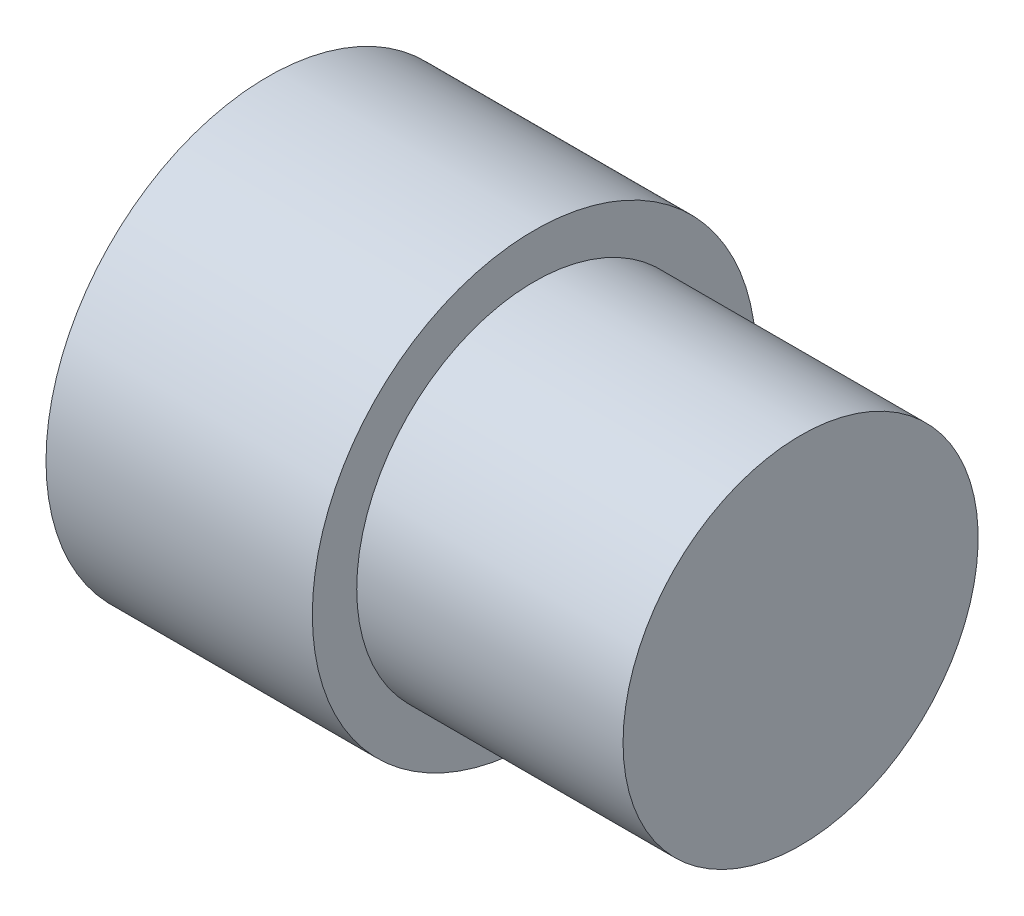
ISO-10303-21;
HEADER;
FILE_DESCRIPTION(('STEP AP214'),'2;1');
FILE_NAME('part.step','',(''),(''),'','','');
FILE_SCHEMA(('AUTOMOTIVE_DESIGN { 1 0 10303 214 1 1 1 1 }'));
ENDSEC;
DATA;
#1=APPLICATION_CONTEXT('core data for automotive mechanical design processes');
#2=APPLICATION_PROTOCOL_DEFINITION('international standard','automotive_design',2000,#1);
#3=PRODUCT_CONTEXT('',#1,'mechanical');
#4=PRODUCT('Part','Part','',(#3));
#5=PRODUCT_RELATED_PRODUCT_CATEGORY('part','',(#4));
#6=PRODUCT_DEFINITION_FORMATION('','',#4);
#7=PRODUCT_DEFINITION_CONTEXT('part definition',#1,'design');
#8=PRODUCT_DEFINITION('design','',#6,#7);
#9=PRODUCT_DEFINITION_SHAPE('','',#8);
#10=(LENGTH_UNIT() NAMED_UNIT(*) SI_UNIT(.MILLI.,.METRE.));
#11=(NAMED_UNIT(*) PLANE_ANGLE_UNIT() SI_UNIT($,.RADIAN.));
#12=(NAMED_UNIT(*) SI_UNIT($,.STERADIAN.) SOLID_ANGLE_UNIT());
#13=UNCERTAINTY_MEASURE_WITH_UNIT(LENGTH_MEASURE(1.E-05),#10,'distance_accuracy_value','');
#14=(GEOMETRIC_REPRESENTATION_CONTEXT(3) GLOBAL_UNCERTAINTY_ASSIGNED_CONTEXT((#13)) GLOBAL_UNIT_ASSIGNED_CONTEXT((#10,
#11,#12)) REPRESENTATION_CONTEXT('',''));
#15=CARTESIAN_POINT('',(0.,0.,0.));
#16=DIRECTION('',(0.,0.,1.));
#17=DIRECTION('',(1.,0.,0.));
#18=AXIS2_PLACEMENT_3D('',#15,#16,#17);
#19=CARTESIAN_POINT('',(0.,0.,-2.5));
#20=DIRECTION('',(1.,0.,0.));
#21=DIRECTION('',(0.,0.,-1.));
#22=AXIS2_PLACEMENT_3D('',#19,#20,#21);
#23=PLANE('',#22);
#24=CARTESIAN_POINT('',(0.,0.,0.));
#25=DIRECTION('',(-1.,0.,0.));
#26=DIRECTION('',(0.,0.,1.));
#27=AXIS2_PLACEMENT_3D('',#24,#25,#26);
#28=CIRCLE('',#27,2.5);
#29=CARTESIAN_POINT('',(0.,0.,2.5));
#30=VERTEX_POINT('',#29);
#31=EDGE_CURVE('E44',#30,#30,#28,.T.);
#32=ORIENTED_EDGE('',*,*,#31,.T.);
#33=EDGE_LOOP('',(#32));
#34=FACE_BOUND('',#33,.T.);
#35=ADVANCED_FACE('F30',(#34),#23,.F.);
#36=CARTESIAN_POINT('',(6.00000000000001,0.,0.));
#37=DIRECTION('',(-1.,0.,0.));
#38=DIRECTION('',(0.,0.,1.));
#39=AXIS2_PLACEMENT_3D('',#36,#37,#38);
#40=PLANE('',#39);
#41=CARTESIAN_POINT('',(6.00000000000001,0.,0.));
#42=DIRECTION('',(-1.,0.,0.));
#43=DIRECTION('',(0.,0.,1.));
#44=AXIS2_PLACEMENT_3D('',#41,#42,#43);
#45=CIRCLE('',#44,2.);
#46=CARTESIAN_POINT('',(6.00000000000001,0.,2.));
#47=VERTEX_POINT('',#46);
#48=EDGE_CURVE('E10',#47,#47,#45,.T.);
#49=ORIENTED_EDGE('',*,*,#48,.F.);
#50=EDGE_LOOP('',(#49));
#51=FACE_BOUND('',#50,.T.);
#52=ADVANCED_FACE('F64',(#51),#40,.F.);
#53=CARTESIAN_POINT('',(0.,0.,0.));
#54=DIRECTION('',(-1.,0.,0.));
#55=DIRECTION('',(0.,0.,1.));
#56=AXIS2_PLACEMENT_3D('',#53,#54,#55);
#57=CYLINDRICAL_SURFACE('',#56,2.);
#58=CARTESIAN_POINT('',(3.,0.,0.));
#59=DIRECTION('',(-1.,0.,0.));
#60=DIRECTION('',(0.,0.,1.));
#61=AXIS2_PLACEMENT_3D('',#58,#59,#60);
#62=CIRCLE('',#61,2.);
#63=CARTESIAN_POINT('',(3.,0.,2.));
#64=VERTEX_POINT('',#63);
#65=EDGE_CURVE('E36',#64,#64,#62,.T.);
#66=ORIENTED_EDGE('',*,*,#65,.F.);
#67=EDGE_LOOP('',(#66));
#68=FACE_BOUND('',#67,.T.);
#69=ORIENTED_EDGE('',*,*,#48,.T.);
#70=EDGE_LOOP('',(#69));
#71=FACE_BOUND('',#70,.T.);
#72=ADVANCED_FACE('F59',(#68,#71),#57,.T.);
#73=CARTESIAN_POINT('',(3.,0.,-2.));
#74=DIRECTION('',(-1.,0.,0.));
#75=DIRECTION('',(0.,0.,1.));
#76=AXIS2_PLACEMENT_3D('',#73,#74,#75);
#77=PLANE('',#76);
#78=CARTESIAN_POINT('',(3.,0.,0.));
#79=DIRECTION('',(-1.,0.,0.));
#80=DIRECTION('',(0.,0.,1.));
#81=AXIS2_PLACEMENT_3D('',#78,#79,#80);
#82=CIRCLE('',#81,2.5);
#83=CARTESIAN_POINT('',(3.,0.,2.5));
#84=VERTEX_POINT('',#83);
#85=EDGE_CURVE('E40',#84,#84,#82,.T.);
#86=ORIENTED_EDGE('',*,*,#85,.F.);
#87=EDGE_LOOP('',(#86));
#88=FACE_BOUND('',#87,.T.);
#89=ORIENTED_EDGE('',*,*,#65,.T.);
#90=EDGE_LOOP('',(#89));
#91=FACE_BOUND('',#90,.T.);
#92=ADVANCED_FACE('F54',(#88,#91),#77,.F.);
#93=CARTESIAN_POINT('',(0.,0.,0.));
#94=DIRECTION('',(-1.,0.,0.));
#95=DIRECTION('',(0.,0.,1.));
#96=AXIS2_PLACEMENT_3D('',#93,#94,#95);
#97=CYLINDRICAL_SURFACE('',#96,2.5);
#98=ORIENTED_EDGE('',*,*,#31,.F.);
#99=EDGE_LOOP('',(#98));
#100=FACE_BOUND('',#99,.T.);
#101=ORIENTED_EDGE('',*,*,#85,.T.);
#102=EDGE_LOOP('',(#101));
#103=FACE_BOUND('',#102,.T.);
#104=ADVANCED_FACE('F51',(#100,#103),#97,.T.);
#105=CLOSED_SHELL('',(#35,#52,#72,#92,#104));
#106=MANIFOLD_SOLID_BREP('B2',#105);
#107=ADVANCED_BREP_SHAPE_REPRESENTATION('',(#18,#106),#14);
#108=SHAPE_DEFINITION_REPRESENTATION(#9,#107);
ENDSEC;
END-ISO-10303-21;
